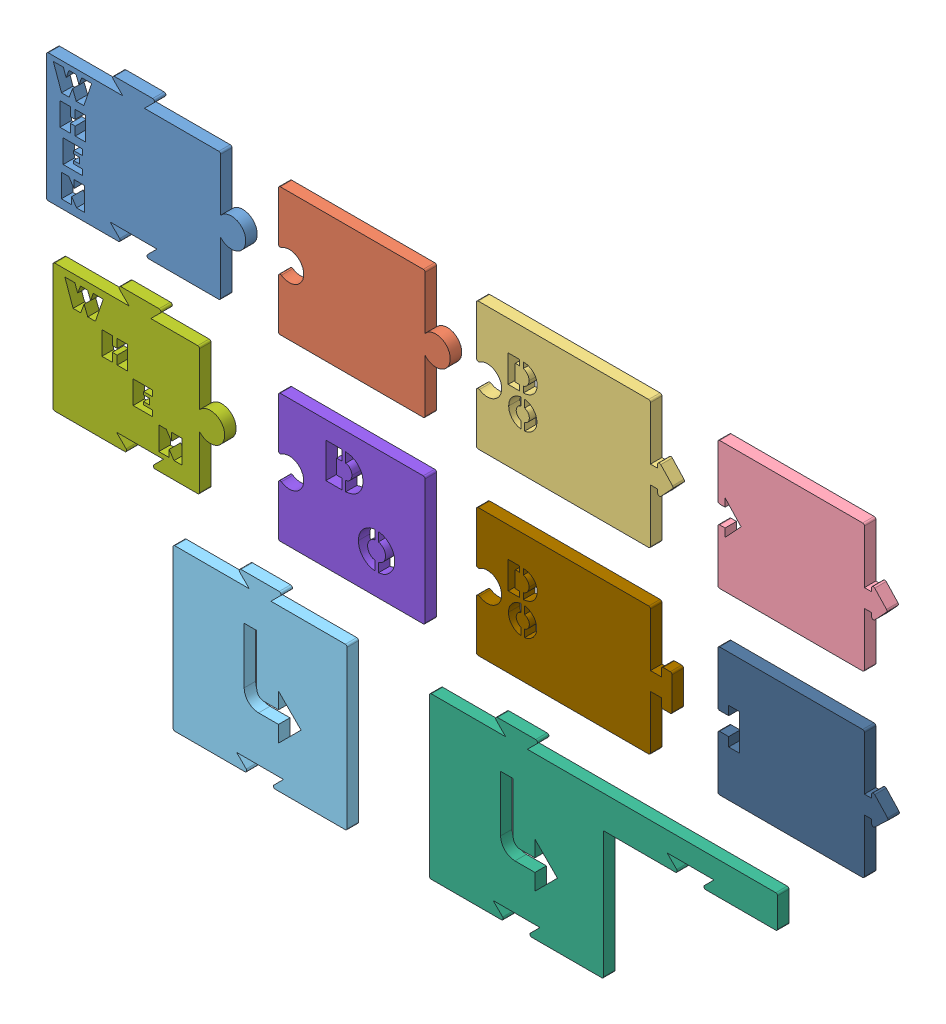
SolidWorks assembly AllTiles.SLDASM, configuration Default (file format 6000). Lengths in mm.
Overall size (233.36 148.91 3.17).
10 component instances, 10 part files, 19 mates.
Components (placement in the parent):
- WhenPredicate-1: WhenPredicate.SLDPRT [Default] at (0.838 25.7674 54.9451) size (55.26 39.06 3.17)
- WhenArgument-1: WhenArgument.SLDPRT [Default] at (65.1695 25.7674 54.9451) size (47.64 35.56 3.17)
- DoAction-1: DoAction.SLDPRT [Default] at (120.0655 25.7674 54.9451) size (54.51 35.56 3.17)
- DoArgument-1: DoArgument.SLDPRT [Default] at (187.015 25.7674 54.9451) size (46.89 35.56 3.17)
- MoreIndent-2: MoreIndent.SLDPRT [Default] at (35.9347 -84.0776 54.9451) size (48.26 48.06 3.17)
- Indent-1: Indent.SLDPRT [Default] at (107.0517 -84.0776 54.9451) size (96.52 48.06 3.17)
- EmptyWhen-1: EmptyWhen.SLDPRT [Default] at (2.6174 -23.8336 54.9451) size (47.64 39.06 3.17)
- EmptyDo-1: EmptyDo.SLDPRT [Default] at (65.1695 -23.8336 54.9451) size (40.64 35.56 3.17)
- DoCreate-1: DoCreate.SLDPRT [Default] at (120.0655 -23.8336 54.9451) size (54.26 35.56 3.17)
- Creatable-1: Creatable.SLDPRT [Default] at (187.015 -23.8336 54.9451) size (47.18 35.56 3.17)
Mates (geometry in assembly coordinates):
- Coincident1: coincident aligned: plane of WhenPredicate-1 through (52.098 43.5474 58.1201) normal (0 0 1); plane of WhenArgument-1 through (108.8095 43.5474 58.1201) normal (0 0 1)
- Coincident2: coincident aligned: plane of WhenPredicate-1 through (49.098 61.3274 58.1201) normal (0 1 0); plane of WhenArgument-1 through (65.1695 61.3274 58.1201) normal (0 1 0)
- Coincident3: coincident aligned: plane of WhenArgument-1 through (108.8095 43.5474 58.1201) normal (0 0 1); plane of DoAction-1 through (123.0655 43.5474 58.1201) normal (0 0 1)
- Coincident4: coincident aligned: plane of WhenArgument-1 through (65.1695 61.3274 58.1201) normal (0 1 0); plane of DoAction-1 through (120.0655 61.3274 58.1201) normal (0 1 0)
- Coincident5: coincident aligned: plane of DoAction-1 through (123.0655 43.5474 58.1201) normal (0 0 1); plane of DoArgument-1 through (187.015 25.7674 58.1201) normal (0 0 1)
- Coincident6: coincident aligned: plane of DoAction-1 through (120.0655 61.3274 58.1201) normal (0 1 0); plane of DoArgument-1 through (187.015 61.3274 58.1201) normal (0 1 0)
- Coincident12: coincident aligned: plane of WhenPredicate-1 through (52.098 43.5474 58.1201) normal (0 0 1); plane of Indent-1 through (107.0517 -84.0776 58.1201) normal (0 0 1)
- Coincident14: coincident aligned: plane of MoreIndent-2 through (35.9347 -84.0776 58.1201) normal (0 0 1); plane of Indent-1 through (107.0517 -84.0776 58.1201) normal (0 0 1)
- Coincident18: coincident aligned: plane of WhenPredicate-1 through (52.098 43.5474 58.1201) normal (0 0 1); plane of EmptyWhen-1 through (46.2574 -6.0536 58.1201) normal (0 0 1)
- Coincident19: coincident aligned: plane of EmptyWhen-1 through (46.2574 -6.0536 58.1201) normal (0 0 1); plane of EmptyDo-1 through (68.1695 -6.0536 58.1201) normal (0 0 1)
- Coincident20: coincident aligned: plane of EmptyWhen-1 through (43.2574 11.7264 58.1201) normal (0 1 0); plane of EmptyDo-1 through (65.1695 11.7264 58.1201) normal (0 1 0)
- Coincident21: coincident aligned: plane of MoreIndent-2 through (63.0647 -39.5176 58.1201) normal (0 1 0); plane of Indent-1 through (107.0517 -39.5176 58.1201) normal (0 1 0)
- Coincident24: coincident aligned: plane of EmptyDo-1 through (68.1695 -6.0536 58.1201) normal (0 0 1); plane of DoCreate-1 through (123.0655 -6.0536 58.1201) normal (0 0 1)
- Coincident25: coincident aligned: plane of EmptyDo-1 through (65.1695 11.7264 58.1201) normal (0 1 0); plane of DoCreate-1 through (120.0655 11.7264 58.1201) normal (0 1 0)
- Coincident26: coincident aligned: plane of WhenArgument-1 through (65.1695 40.9016 58.1201) normal (-1 0 0); plane of EmptyDo-1 through (65.1695 11.7264 58.1201) normal (-1 0 0)
- Coincident27: coincident aligned: plane of DoAction-1 through (120.0655 40.9016 58.1201) normal (-1 0 0); plane of DoCreate-1 through (120.0655 11.7264 58.1201) normal (-1 0 0)
- Coincident28: coincident aligned: plane of DoCreate-1 through (123.0655 -6.0536 58.1201) normal (0 0 1); plane of Creatable-1 through (187.015 -23.8336 58.1201) normal (0 0 1)
- Coincident29: coincident aligned: plane of DoCreate-1 through (120.0655 11.7264 58.1201) normal (0 1 0); plane of Creatable-1 through (187.015 11.7264 58.1201) normal (0 1 0)
- Coincident30: coincident aligned: plane of DoArgument-1 through (187.015 41.0474 58.1201) normal (-1 0 0); plane of Creatable-1 through (187.015 11.7264 58.1201) normal (-1 0 0)
